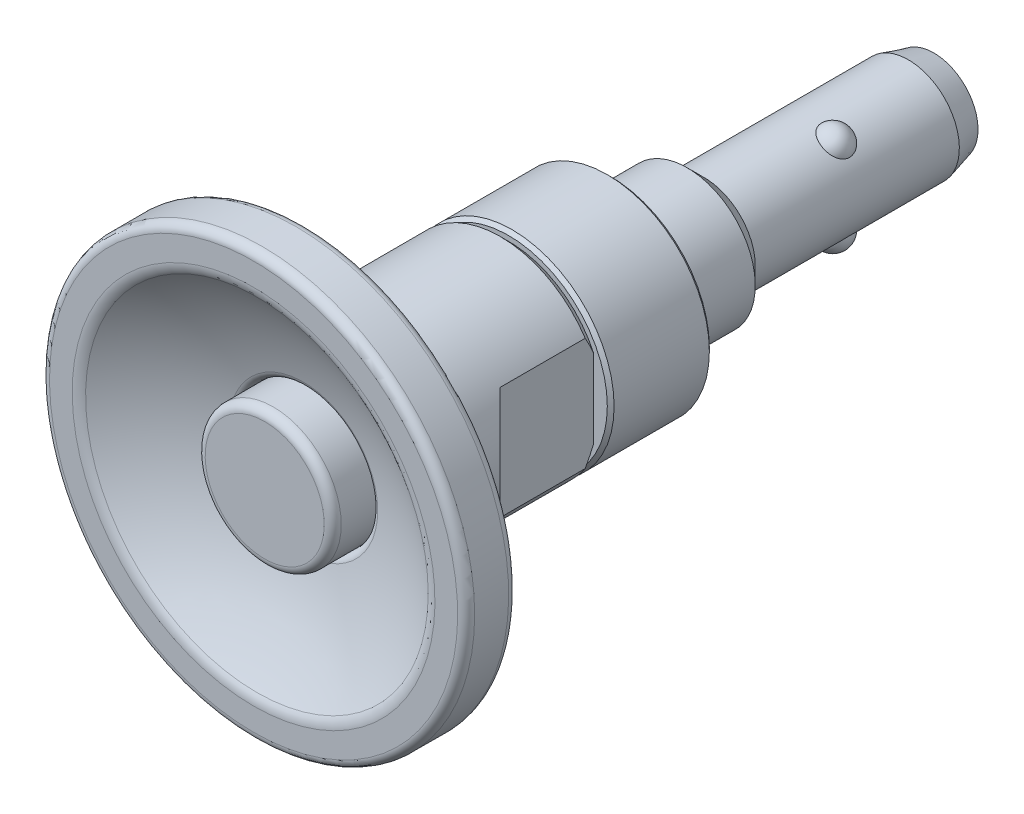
ISO-10303-21;
HEADER;
FILE_DESCRIPTION(('STEP AP214'),'2;1');
FILE_NAME('part.step','',(''),(''),'','','');
FILE_SCHEMA(('AUTOMOTIVE_DESIGN { 1 0 10303 214 1 1 1 1 }'));
ENDSEC;
DATA;
#1=APPLICATION_CONTEXT('core data for automotive mechanical design processes');
#2=APPLICATION_PROTOCOL_DEFINITION('international standard','automotive_design',2000,#1);
#3=PRODUCT_CONTEXT('',#1,'mechanical');
#4=PRODUCT('Part','Part','',(#3));
#5=PRODUCT_RELATED_PRODUCT_CATEGORY('part','',(#4));
#6=PRODUCT_DEFINITION_FORMATION('','',#4);
#7=PRODUCT_DEFINITION_CONTEXT('part definition',#1,'design');
#8=PRODUCT_DEFINITION('design','',#6,#7);
#9=PRODUCT_DEFINITION_SHAPE('','',#8);
#10=(LENGTH_UNIT() NAMED_UNIT(*) SI_UNIT(.MILLI.,.METRE.));
#11=(NAMED_UNIT(*) PLANE_ANGLE_UNIT() SI_UNIT($,.RADIAN.));
#12=(NAMED_UNIT(*) SI_UNIT($,.STERADIAN.) SOLID_ANGLE_UNIT());
#13=UNCERTAINTY_MEASURE_WITH_UNIT(LENGTH_MEASURE(1.E-05),#10,'distance_accuracy_value','');
#14=(GEOMETRIC_REPRESENTATION_CONTEXT(3) GLOBAL_UNCERTAINTY_ASSIGNED_CONTEXT((#13)) GLOBAL_UNIT_ASSIGNED_CONTEXT((#10,
#11,#12)) REPRESENTATION_CONTEXT('',''));
#15=CARTESIAN_POINT('',(0.,0.,0.));
#16=DIRECTION('',(0.,0.,1.));
#17=DIRECTION('',(1.,0.,0.));
#18=AXIS2_PLACEMENT_3D('',#15,#16,#17);
#19=CARTESIAN_POINT('',(1.25745735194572,-2.17798002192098,-11.8));
#20=DIRECTION('',(-0.500000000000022,0.866025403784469,0.));
#21=DIRECTION('',(0.,0.,-1.));
#22=AXIS2_PLACEMENT_3D('',#19,#20,#21);
#23=SPHERICAL_SURFACE('',#22,1.);
#24=CARTESIAN_POINT('',(2.2405663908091,-1.99495920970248,-11.8));
#25=CARTESIAN_POINT('',(2.24056631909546,-1.99495956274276,-11.8461997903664));
#26=CARTESIAN_POINT('',(2.23786747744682,-1.99800289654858,-11.8924030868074));
#27=CARTESIAN_POINT('',(2.22713107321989,-2.00996266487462,-11.983409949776));
#28=CARTESIAN_POINT('',(2.21909208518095,-2.0188806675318,-12.0282131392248));
#29=CARTESIAN_POINT('',(2.19786885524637,-2.04196358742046,-12.1150425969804));
#30=CARTESIAN_POINT('',(2.18469611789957,-2.05611676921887,-12.1570748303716));
#31=CARTESIAN_POINT('',(2.15345971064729,-2.08880832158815,-12.2374414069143));
#32=CARTESIAN_POINT('',(2.13539539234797,-2.10734727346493,-12.2757752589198));
#33=CARTESIAN_POINT('',(2.09404035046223,-2.14845746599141,-12.3491094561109));
#34=CARTESIAN_POINT('',(2.07060081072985,-2.17113880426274,-12.3839637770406));
#35=CARTESIAN_POINT('',(2.01925802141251,-2.21896993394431,-12.4482638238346));
#36=CARTESIAN_POINT('',(1.99135360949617,-2.24412036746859,-12.4777081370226));
#37=CARTESIAN_POINT('',(1.92921474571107,-2.29781233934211,-12.5328114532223));
#38=CARTESIAN_POINT('',(1.89465658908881,-2.32646544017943,-12.5579971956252));
#39=CARTESIAN_POINT('',(1.82157431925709,-2.38412134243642,-12.6011946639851));
#40=CARTESIAN_POINT('',(1.78304902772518,-2.41312424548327,-12.6192042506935));
#41=CARTESIAN_POINT('',(1.70065330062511,-2.47193714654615,-12.648581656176));
#42=CARTESIAN_POINT('',(1.65660658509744,-2.5017061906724,-12.6595384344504));
#43=CARTESIAN_POINT('',(1.56606022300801,-2.55936273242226,-12.6730632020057));
#44=CARTESIAN_POINT('',(1.51956022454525,-2.58724995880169,-12.675629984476));
#45=CARTESIAN_POINT('',(1.42431874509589,-2.6409024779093,-12.6723034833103));
#46=CARTESIAN_POINT('',(1.37555056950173,-2.66660929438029,-12.6662272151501));
#47=CARTESIAN_POINT('',(1.27819603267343,-2.71462002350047,-12.6453652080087));
#48=CARTESIAN_POINT('',(1.22960968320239,-2.7369237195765,-12.630578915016));
#49=CARTESIAN_POINT('',(1.13428398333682,-2.77778449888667,-12.5925339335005));
#50=CARTESIAN_POINT('',(1.08754241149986,-2.79634620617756,-12.5692858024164));
#51=CARTESIAN_POINT('',(0.997563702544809,-2.82969436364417,-12.5146818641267));
#52=CARTESIAN_POINT('',(0.95432641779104,-2.84448097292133,-12.4833263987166));
#53=CARTESIAN_POINT('',(0.874277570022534,-2.87008012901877,-12.4140490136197));
#54=CARTESIAN_POINT('',(0.837323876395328,-2.88098931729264,-12.3763275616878));
#55=CARTESIAN_POINT('',(0.770184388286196,-2.89966092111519,-12.2945932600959));
#56=CARTESIAN_POINT('',(0.739995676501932,-2.90742469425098,-12.2505831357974));
#57=CARTESIAN_POINT('',(0.689722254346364,-2.91974521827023,-12.1605282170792));
#58=CARTESIAN_POINT('',(0.669105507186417,-2.92447862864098,-12.1148051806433));
#59=CARTESIAN_POINT('',(0.636345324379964,-2.93178281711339,-12.0202582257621));
#60=CARTESIAN_POINT('',(0.624196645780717,-2.93435493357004,-11.9714362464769));
#61=CARTESIAN_POINT('',(0.60969621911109,-2.93740024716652,-11.8762808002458));
#62=CARTESIAN_POINT('',(0.606642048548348,-2.93802412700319,-11.8300582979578));
#63=CARTESIAN_POINT('',(0.608482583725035,-2.9376436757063,-11.7377843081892));
#64=CARTESIAN_POINT('',(0.613375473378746,-2.93663971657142,-11.6917327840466));
#65=CARTESIAN_POINT('',(0.63053844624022,-2.93300068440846,-11.6027655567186));
#66=CARTESIAN_POINT('',(0.642547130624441,-2.930423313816,-11.559796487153));
#67=CARTESIAN_POINT('',(0.673148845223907,-2.92354492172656,-11.476425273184));
#68=CARTESIAN_POINT('',(0.691742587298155,-2.9192437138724,-11.4360234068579));
#69=CARTESIAN_POINT('',(0.735458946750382,-2.90854284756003,-11.357373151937));
#70=CARTESIAN_POINT('',(0.760784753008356,-2.90207588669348,-11.3192472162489));
#71=CARTESIAN_POINT('',(0.816602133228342,-2.88686621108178,-11.2475035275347));
#72=CARTESIAN_POINT('',(0.847095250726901,-2.87812281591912,-11.2138871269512));
#73=CARTESIAN_POINT('',(0.914597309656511,-2.85741947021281,-11.1494153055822));
#74=CARTESIAN_POINT('',(0.951922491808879,-2.84526835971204,-11.1189523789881));
#75=CARTESIAN_POINT('',(1.02996337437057,-2.81795761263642,-11.0643839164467));
#76=CARTESIAN_POINT('',(1.07068016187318,-2.80279700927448,-11.0402804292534));
#77=CARTESIAN_POINT('',(1.15709228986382,-2.76829255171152,-10.9973428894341));
#78=CARTESIAN_POINT('',(1.20293761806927,-2.74873331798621,-10.978982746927));
#79=CARTESIAN_POINT('',(1.29557162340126,-2.70630578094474,-10.9501623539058));
#80=CARTESIAN_POINT('',(1.3423604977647,-2.68343677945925,-10.9397037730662));
#81=CARTESIAN_POINT('',(1.43722588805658,-2.63388425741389,-10.92658991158));
#82=CARTESIAN_POINT('',(1.48528716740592,-2.60709207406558,-10.9242329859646));
#83=CARTESIAN_POINT('',(1.57959366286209,-2.55105735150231,-10.9281888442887));
#84=CARTESIAN_POINT('',(1.62583870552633,-2.52181457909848,-10.9345024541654));
#85=CARTESIAN_POINT('',(1.71569281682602,-2.46157455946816,-10.9558082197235));
#86=CARTESIAN_POINT('',(1.75927518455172,-2.43056416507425,-10.9708760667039));
#87=CARTESIAN_POINT('',(1.84227905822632,-2.36826975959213,-11.0095322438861));
#88=CARTESIAN_POINT('',(1.88170046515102,-2.33698574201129,-11.0331207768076));
#89=CARTESIAN_POINT('',(1.95498929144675,-2.27601892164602,-11.0880826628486));
#90=CARTESIAN_POINT('',(1.98892124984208,-2.24632076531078,-11.1193526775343));
#91=CARTESIAN_POINT('',(2.05107923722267,-2.18971305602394,-11.1892521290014));
#92=CARTESIAN_POINT('',(2.07930615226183,-2.16280307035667,-11.2278804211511));
#93=CARTESIAN_POINT('',(2.12825022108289,-2.11463443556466,-11.3096673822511));
#94=CARTESIAN_POINT('',(2.14925472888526,-2.09317171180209,-11.3525332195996));
#95=CARTESIAN_POINT('',(2.18501161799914,-2.05582036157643,-11.4430266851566));
#96=CARTESIAN_POINT('',(2.19976977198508,-2.03992659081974,-11.4906498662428));
#97=CARTESIAN_POINT('',(2.22094703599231,-2.01682944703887,-11.5816600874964));
#98=CARTESIAN_POINT('',(2.22829180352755,-2.00867324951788,-11.6245931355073));
#99=CARTESIAN_POINT('',(2.23810081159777,-1.99773873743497,-11.7116832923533));
#100=CARTESIAN_POINT('',(2.2405664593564,-1.9949588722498,-11.7558400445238));
#101=CARTESIAN_POINT('',(2.2405663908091,-1.99495920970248,-11.8));
#102=B_SPLINE_CURVE_WITH_KNOTS('',3,(#24,#25,#26,#27,#28,#29,#30,#31,#32,#33,#34,#35,#36,#37,
#38,#39,#40,#41,#42,#43,#44,#45,#46,#47,#48,#49,#50,#51,#52,#53,#54,#55,#56,#57,#58,#59,#60,#61,
#62,#63,#64,#65,#66,#67,#68,#69,#70,#71,#72,#73,#74,#75,#76,#77,#78,#79,#80,#81,#82,#83,#84,#85,
#86,#87,#88,#89,#90,#91,#92,#93,#94,#95,#96,#97,#98,#99,#100,#101),.UNSPECIFIED.,.T.,.F.,(4,2,2,
2,2,2,2,2,2,2,2,2,2,2,2,2,2,2,2,2,2,2,2,2,2,2,2,2,2,2,2,2,2,2,2,2,2,2,4),(0.,0.138430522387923,
0.276898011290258,0.415056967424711,0.553234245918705,0.695835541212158,0.838474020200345,
0.992219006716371,1.14600979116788,1.30810293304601,1.47021938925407,1.63581958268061,
1.80143031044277,1.96683511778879,2.1322329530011,2.29315873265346,2.45401498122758,
2.60434189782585,2.75457565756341,2.89285916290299,3.03111107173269,3.16457426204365,
3.29805188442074,3.43613636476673,3.57426216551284,3.72268228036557,3.87115015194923,
4.02978554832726,4.18845445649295,4.35290739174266,4.51737599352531,4.68328825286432,
4.84920445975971,5.01300034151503,5.17677076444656,5.33295320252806,5.48899098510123,
5.62134763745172,5.75366611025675),.UNSPECIFIED.);
#103=CARTESIAN_POINT('',(2.2405663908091,-1.99495920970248,-11.8));
#104=VERTEX_POINT('',#103);
#105=EDGE_CURVE('E9',#104,#104,#102,.T.);
#106=ORIENTED_EDGE('',*,*,#105,.F.);
#107=EDGE_LOOP('',(#106));
#108=FACE_BOUND('',#107,.T.);
#109=ADVANCED_FACE('F14',(#108),#23,.T.);
#110=CARTESIAN_POINT('',(0.,0.,20.3464045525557));
#111=DIRECTION('',(0.,0.,-1.));
#112=DIRECTION('',(0.,1.,0.));
#113=AXIS2_PLACEMENT_3D('',#110,#111,#112);
#114=PLANE('',#113);
#115=CARTESIAN_POINT('',(0.,0.,20.3464045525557));
#116=DIRECTION('',(0.,0.,-1.));
#117=DIRECTION('',(0.,1.,0.));
#118=AXIS2_PLACEMENT_3D('',#115,#116,#117);
#119=CIRCLE('',#118,3.5);
#120=CARTESIAN_POINT('',(0.,3.5,20.3464045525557));
#121=VERTEX_POINT('',#120);
#122=EDGE_CURVE('E330',#121,#121,#119,.F.);
#123=ORIENTED_EDGE('',*,*,#122,.T.);
#124=EDGE_LOOP('',(#123));
#125=FACE_BOUND('',#124,.T.);
#126=ADVANCED_FACE('F258',(#125),#114,.F.);
#127=CARTESIAN_POINT('',(0.,0.,19.8464045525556));
#128=DIRECTION('',(0.,0.,-1.));
#129=DIRECTION('',(0.,1.,0.));
#130=AXIS2_PLACEMENT_3D('',#127,#128,#129);
#131=TOROIDAL_SURFACE('',#130,3.5,0.5);
#132=CARTESIAN_POINT('',(0.,0.,19.8464045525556));
#133=DIRECTION('',(0.,0.,-1.));
#134=DIRECTION('',(0.,1.,0.));
#135=AXIS2_PLACEMENT_3D('',#132,#133,#134);
#136=CIRCLE('',#135,4.);
#137=CARTESIAN_POINT('',(0.,4.,19.8464045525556));
#138=VERTEX_POINT('',#137);
#139=EDGE_CURVE('E84',#138,#138,#136,.T.);
#140=ORIENTED_EDGE('',*,*,#139,.F.);
#141=EDGE_LOOP('',(#140));
#142=FACE_BOUND('',#141,.T.);
#143=ORIENTED_EDGE('',*,*,#122,.F.);
#144=EDGE_LOOP('',(#143));
#145=FACE_BOUND('',#144,.T.);
#146=ADVANCED_FACE('F260',(#142,#145),#131,.T.);
#147=CARTESIAN_POINT('',(0.,0.,79.9579051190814));
#148=DIRECTION('',(0.,0.,1.));
#149=DIRECTION('',(0.,-1.,0.));
#150=AXIS2_PLACEMENT_3D('',#147,#148,#149);
#151=CYLINDRICAL_SURFACE('',#150,4.);
#152=ORIENTED_EDGE('',*,*,#139,.T.);
#153=EDGE_LOOP('',(#152));
#154=FACE_BOUND('',#153,.T.);
#155=CARTESIAN_POINT('',(0.,0.,17.5884654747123));
#156=DIRECTION('',(0.,0.,1.));
#157=DIRECTION('',(0.,-1.,0.));
#158=AXIS2_PLACEMENT_3D('',#155,#156,#157);
#159=CIRCLE('',#158,4.);
#160=CARTESIAN_POINT('',(0.,-4.,17.5884654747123));
#161=VERTEX_POINT('',#160);
#162=EDGE_CURVE('E361',#161,#161,#159,.T.);
#163=ORIENTED_EDGE('',*,*,#162,.T.);
#164=EDGE_LOOP('',(#163));
#165=FACE_BOUND('',#164,.T.);
#166=ADVANCED_FACE('F268',(#154,#165),#151,.T.);
#167=CARTESIAN_POINT('',(0.,0.,17.5884654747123));
#168=DIRECTION('',(0.,0.,1.));
#169=DIRECTION('',(0.,-1.,0.));
#170=AXIS2_PLACEMENT_3D('',#167,#168,#169);
#171=TOROIDAL_SURFACE('',#170,4.5,0.5);
#172=CARTESIAN_POINT('',(0.,0.,18.0716521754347));
#173=DIRECTION('',(0.,0.,1.));
#174=DIRECTION('',(0.,-1.,0.));
#175=AXIS2_PLACEMENT_3D('',#172,#173,#174);
#176=CIRCLE('',#175,4.37142857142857);
#177=CARTESIAN_POINT('',(4.37142857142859,0.,18.0716521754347));
#178=VERTEX_POINT('',#177);
#179=EDGE_CURVE('E358',#178,#178,#176,.F.);
#180=ORIENTED_EDGE('',*,*,#179,.F.);
#181=EDGE_LOOP('',(#180));
#182=FACE_BOUND('',#181,.T.);
#183=ORIENTED_EDGE('',*,*,#162,.F.);
#184=EDGE_LOOP('',(#183));
#185=FACE_BOUND('',#184,.T.);
#186=ADVANCED_FACE('F183',(#182,#185),#171,.T.);
#187=CARTESIAN_POINT('',(0.,0.,34.5));
#188=DIRECTION('',(0.,0.,-1.));
#189=DIRECTION('',(1.,0.,0.));
#190=AXIS2_PLACEMENT_3D('',#187,#188,#189);
#191=SPHERICAL_SURFACE('',#190,17.);
#192=CARTESIAN_POINT('',(0.,0.,20.8055555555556));
#193=DIRECTION('',(0.,0.,1.));
#194=DIRECTION('',(0.,-1.,0.));
#195=AXIS2_PLACEMENT_3D('',#192,#193,#194);
#196=CIRCLE('',#195,10.0728442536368);
#197=CARTESIAN_POINT('',(10.0728442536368,0.,20.8055555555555));
#198=VERTEX_POINT('',#197);
#199=EDGE_CURVE('E355',#198,#198,#196,.T.);
#200=CARTESIAN_POINT('',(10.0728442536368,0.,20.8055555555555));
#201=CARTESIAN_POINT('',(10.0194759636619,0.,20.7663008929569));
#202=CARTESIAN_POINT('',(9.96587818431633,0.,20.7273582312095));
#203=CARTESIAN_POINT('',(9.85823102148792,0.,20.6501021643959));
#204=CARTESIAN_POINT('',(9.8041816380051,0.,20.6117887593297));
#205=CARTESIAN_POINT('',(9.69563864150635,0.,20.5357964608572));
#206=CARTESIAN_POINT('',(9.64114502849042,0.,20.4981175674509));
#207=CARTESIAN_POINT('',(9.53172102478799,0.,20.4233994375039));
#208=CARTESIAN_POINT('',(9.47679063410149,0.,20.3863602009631));
#209=CARTESIAN_POINT('',(9.36650058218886,0.,20.3129264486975));
#210=CARTESIAN_POINT('',(9.31114092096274,0.,20.2765319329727));
#211=CARTESIAN_POINT('',(9.19999989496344,0.,20.204392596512));
#212=CARTESIAN_POINT('',(9.14421853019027,0.,20.1686477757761));
#213=CARTESIAN_POINT('',(9.03224172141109,0.,20.0978127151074));
#214=CARTESIAN_POINT('',(8.97604627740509,0.,20.0627224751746));
#215=CARTESIAN_POINT('',(8.86324899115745,0.,19.993201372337));
#216=CARTESIAN_POINT('',(8.80664714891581,0.,19.9587705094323));
#217=CARTESIAN_POINT('',(8.69304480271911,0.,19.8905728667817));
#218=CARTESIAN_POINT('',(8.63604429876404,0.,19.8568060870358));
#219=CARTESIAN_POINT('',(8.52165242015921,0.,19.7899412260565));
#220=CARTESIAN_POINT('',(8.46426104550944,0.,19.756843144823));
#221=CARTESIAN_POINT('',(8.3490952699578,0.,19.6913202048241));
#222=CARTESIAN_POINT('',(8.29132086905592,0.,19.6588953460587));
#223=CARTESIAN_POINT('',(8.17539693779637,0.,19.5947232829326));
#224=CARTESIAN_POINT('',(8.11724740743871,0.,19.5629760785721));
#225=CARTESIAN_POINT('',(8.00058116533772,0.,19.5001636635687));
#226=CARTESIAN_POINT('',(7.94206445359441,0.,19.4690984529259));
#227=CARTESIAN_POINT('',(7.82467184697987,0.,19.407654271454));
#228=CARTESIAN_POINT('',(7.76579595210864,0.,19.3772753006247));
#229=CARTESIAN_POINT('',(7.64769302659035,0.,19.3172077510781));
#230=CARTESIAN_POINT('',(7.58846599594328,0.,19.2875191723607));
#231=CARTESIAN_POINT('',(7.46966889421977,0.,19.2288364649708));
#232=CARTESIAN_POINT('',(7.41009882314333,0.,19.1998423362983));
#233=CARTESIAN_POINT('',(7.29062378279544,0.,19.1425524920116));
#234=CARTESIAN_POINT('',(7.23071881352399,0.,19.1142567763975));
#235=CARTESIAN_POINT('',(7.11058216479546,0.,19.0583676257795));
#236=CARTESIAN_POINT('',(7.05035048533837,0.,19.0307741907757));
#237=CARTESIAN_POINT('',(6.92956864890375,0.,18.9762933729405));
#238=CARTESIAN_POINT('',(6.86901849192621,0.,18.949405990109));
#239=CARTESIAN_POINT('',(6.74760797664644,0.,18.8963409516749));
#240=CARTESIAN_POINT('',(6.68674761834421,0.,18.8701632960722));
#241=CARTESIAN_POINT('',(6.56472501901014,0.,18.8185212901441));
#242=CARTESIAN_POINT('',(6.5035627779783,0.,18.7930569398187));
#243=CARTESIAN_POINT('',(6.38094477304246,0.,18.7428450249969));
#244=CARTESIAN_POINT('',(6.31948900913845,0.,18.7180974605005));
#245=CARTESIAN_POINT('',(6.19629235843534,0.,18.6693224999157));
#246=CARTESIAN_POINT('',(6.13455147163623,0.,18.6452951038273));
#247=CARTESIAN_POINT('',(6.0107930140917,0.,18.597963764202));
#248=CARTESIAN_POINT('',(5.94877544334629,0.,18.5746598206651));
#249=CARTESIAN_POINT('',(5.82447209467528,0.,18.528778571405));
#250=CARTESIAN_POINT('',(5.76218631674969,0.,18.5062012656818));
#251=CARTESIAN_POINT('',(5.63735506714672,0.,18.4617763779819));
#252=CARTESIAN_POINT('',(5.57480959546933,0.,18.4399287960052));
#253=CARTESIAN_POINT('',(5.44946750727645,0.,18.396966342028));
#254=CARTESIAN_POINT('',(5.38667089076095,0.,18.3758514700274));
#255=CARTESIAN_POINT('',(5.26083509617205,0.,18.3343573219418));
#256=CARTESIAN_POINT('',(5.19779591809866,0.,18.3139780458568));
#257=CARTESIAN_POINT('',(5.07148361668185,0.,18.2739578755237));
#258=CARTESIAN_POINT('',(5.00821049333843,0.,18.2543169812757));
#259=CARTESIAN_POINT('',(4.88143895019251,0.,18.2157762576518));
#260=CARTESIAN_POINT('',(4.81794053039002,0.,18.1968764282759));
#261=CARTESIAN_POINT('',(4.69072707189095,0.,18.1598204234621));
#262=CARTESIAN_POINT('',(4.62701203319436,0.,18.1416642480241));
#263=CARTESIAN_POINT('',(4.49937405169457,0.,18.1060980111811));
#264=CARTESIAN_POINT('',(4.43545110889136,0.,18.088687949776));
#265=CARTESIAN_POINT('',(4.37142857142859,0.,18.0716521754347));
#266=B_SPLINE_CURVE_WITH_KNOTS('',3,(#200,#201,#202,#203,#204,#205,#206,#207,#208,#209,#210,
#211,#212,#213,#214,#215,#216,#217,#218,#219,#220,#221,#222,#223,#224,#225,#226,#227,#228,#229,
#230,#231,#232,#233,#234,#235,#236,#237,#238,#239,#240,#241,#242,#243,#244,#245,#246,#247,#248,
#249,#250,#251,#252,#253,#254,#255,#256,#257,#258,#259,#260,#261,#262,#263,#264,#265),
.UNSPECIFIED.,.F.,.F.,(4,2,2,2,2,2,2,2,2,2,2,2,2,2,2,2,2,2,2,2,2,2,2,2,2,2,2,2,2,2,2,2,4),(0.,
0.198749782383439,0.397499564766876,0.596249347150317,0.794999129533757,0.993748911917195,
1.19249869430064,1.39124847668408,1.58999825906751,1.78874804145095,1.98749782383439,
2.18624760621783,2.38499738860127,2.58374717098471,2.78249695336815,2.98124673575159,
3.17999651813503,3.37874630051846,3.57749608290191,3.77624586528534,3.97499564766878,
4.17374543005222,4.37249521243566,4.5712449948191,4.76999477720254,4.96874455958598,
5.16749434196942,5.36624412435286,5.5649939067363,5.76374368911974,5.96249347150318,
6.16124325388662,6.35999303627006),.UNSPECIFIED.);
#267=EDGE_CURVE('BSEAM179',#198,#178,#266,.T.);
#268=ORIENTED_EDGE('',*,*,#199,.T.);
#269=ORIENTED_EDGE('',*,*,#179,.T.);
#270=ORIENTED_EDGE('',*,*,#267,.T.);
#271=ORIENTED_EDGE('',*,*,#267,.F.);
#272=EDGE_LOOP('',(#268,#270,#269,#271));
#273=FACE_BOUND('',#272,.T.);
#274=ADVANCED_FACE('F179',(#273),#191,.F.);
#275=CARTESIAN_POINT('',(0.,0.,20.));
#276=DIRECTION('',(0.,0.,1.));
#277=DIRECTION('',(0.,-1.,0.));
#278=AXIS2_PLACEMENT_3D('',#275,#276,#277);
#279=TOROIDAL_SURFACE('',#278,10.6653645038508,1.);
#280=CARTESIAN_POINT('',(0.,0.,21.));
#281=DIRECTION('',(0.,0.,1.));
#282=DIRECTION('',(0.,-1.,0.));
#283=AXIS2_PLACEMENT_3D('',#280,#281,#282);
#284=CIRCLE('',#283,10.6653645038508);
#285=CARTESIAN_POINT('',(0.,-10.6653645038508,21.));
#286=VERTEX_POINT('',#285);
#287=EDGE_CURVE('E352',#286,#286,#284,.F.);
#288=ORIENTED_EDGE('',*,*,#287,.F.);
#289=EDGE_LOOP('',(#288));
#290=FACE_BOUND('',#289,.T.);
#291=ORIENTED_EDGE('',*,*,#199,.F.);
#292=EDGE_LOOP('',(#291));
#293=FACE_BOUND('',#292,.T.);
#294=ADVANCED_FACE('F182',(#290,#293),#279,.T.);
#295=CARTESIAN_POINT('',(1.75,0.,21.));
#296=DIRECTION('',(0.,0.,1.));
#297=DIRECTION('',(0.,-1.,0.));
#298=AXIS2_PLACEMENT_3D('',#295,#296,#297);
#299=PLANE('',#298);
#300=ORIENTED_EDGE('',*,*,#287,.T.);
#301=EDGE_LOOP('',(#300));
#302=FACE_BOUND('',#301,.T.);
#303=CARTESIAN_POINT('',(0.,0.,21.));
#304=DIRECTION('',(0.,0.,1.));
#305=DIRECTION('',(0.,-1.,0.));
#306=AXIS2_PLACEMENT_3D('',#303,#304,#305);
#307=CIRCLE('',#306,12.);
#308=CARTESIAN_POINT('',(0.,-12.,21.));
#309=VERTEX_POINT('',#308);
#310=EDGE_CURVE('E130',#309,#309,#307,.T.);
#311=ORIENTED_EDGE('',*,*,#310,.T.);
#312=EDGE_LOOP('',(#311));
#313=FACE_BOUND('',#312,.T.);
#314=ADVANCED_FACE('F185',(#302,#313),#299,.T.);
#315=CARTESIAN_POINT('',(0.,0.,20.5));
#316=DIRECTION('',(0.,0.,1.));
#317=DIRECTION('',(0.,-1.,0.));
#318=AXIS2_PLACEMENT_3D('',#315,#316,#317);
#319=TOROIDAL_SURFACE('',#318,12.,0.5);
#320=ORIENTED_EDGE('',*,*,#310,.F.);
#321=EDGE_LOOP('',(#320));
#322=FACE_BOUND('',#321,.T.);
#323=CARTESIAN_POINT('',(0.,0.,20.5));
#324=DIRECTION('',(0.,0.,1.));
#325=DIRECTION('',(0.,-1.,0.));
#326=AXIS2_PLACEMENT_3D('',#323,#324,#325);
#327=CIRCLE('',#326,12.5);
#328=CARTESIAN_POINT('',(0.,-12.5,20.5));
#329=VERTEX_POINT('',#328);
#330=EDGE_CURVE('E127',#329,#329,#327,.F.);
#331=ORIENTED_EDGE('',*,*,#330,.F.);
#332=EDGE_LOOP('',(#331));
#333=FACE_BOUND('',#332,.T.);
#334=ADVANCED_FACE('F188',(#322,#333),#319,.T.);
#335=CARTESIAN_POINT('',(0.,0.,-5.5));
#336=DIRECTION('',(0.,0.,-1.));
#337=DIRECTION('',(0.,1.,0.));
#338=AXIS2_PLACEMENT_3D('',#335,#336,#337);
#339=CYLINDRICAL_SURFACE('',#338,12.5);
#340=ORIENTED_EDGE('',*,*,#330,.T.);
#341=EDGE_LOOP('',(#340));
#342=FACE_BOUND('',#341,.T.);
#343=CARTESIAN_POINT('',(0.,0.,18.5));
#344=DIRECTION('',(0.,0.,-1.));
#345=DIRECTION('',(0.,1.,0.));
#346=AXIS2_PLACEMENT_3D('',#343,#344,#345);
#347=CIRCLE('',#346,12.5);
#348=CARTESIAN_POINT('',(0.,12.5,18.5));
#349=VERTEX_POINT('',#348);
#350=EDGE_CURVE('E124',#349,#349,#347,.F.);
#351=ORIENTED_EDGE('',*,*,#350,.T.);
#352=EDGE_LOOP('',(#351));
#353=FACE_BOUND('',#352,.T.);
#354=ADVANCED_FACE('F201',(#342,#353),#339,.T.);
#355=CARTESIAN_POINT('',(0.,0.,18.5));
#356=DIRECTION('',(0.,0.,-1.));
#357=DIRECTION('',(0.,1.,0.));
#358=AXIS2_PLACEMENT_3D('',#355,#356,#357);
#359=TOROIDAL_SURFACE('',#358,12.,0.5);
#360=ORIENTED_EDGE('',*,*,#350,.F.);
#361=EDGE_LOOP('',(#360));
#362=FACE_BOUND('',#361,.T.);
#363=CARTESIAN_POINT('',(0.,0.,18.));
#364=DIRECTION('',(0.,0.,-1.));
#365=DIRECTION('',(0.,1.,0.));
#366=AXIS2_PLACEMENT_3D('',#363,#364,#365);
#367=CIRCLE('',#366,12.);
#368=CARTESIAN_POINT('',(0.,12.,18.));
#369=VERTEX_POINT('',#368);
#370=EDGE_CURVE('E133',#369,#369,#367,.T.);
#371=ORIENTED_EDGE('',*,*,#370,.F.);
#372=EDGE_LOOP('',(#371));
#373=FACE_BOUND('',#372,.T.);
#374=ADVANCED_FACE('F199',(#362,#373),#359,.T.);
#375=CARTESIAN_POINT('',(12.5,0.,18.));
#376=DIRECTION('',(0.,0.,-1.));
#377=DIRECTION('',(0.,1.,0.));
#378=AXIS2_PLACEMENT_3D('',#375,#376,#377);
#379=PLANE('',#378);
#380=ORIENTED_EDGE('',*,*,#370,.T.);
#381=EDGE_LOOP('',(#380));
#382=FACE_BOUND('',#381,.T.);
#383=CARTESIAN_POINT('',(0.,0.,18.));
#384=DIRECTION('',(0.,0.,-1.));
#385=DIRECTION('',(0.,1.,0.));
#386=AXIS2_PLACEMENT_3D('',#383,#384,#385);
#387=CIRCLE('',#386,10.);
#388=CARTESIAN_POINT('',(0.,10.,18.));
#389=VERTEX_POINT('',#388);
#390=EDGE_CURVE('E103',#389,#389,#387,.T.);
#391=ORIENTED_EDGE('',*,*,#390,.F.);
#392=EDGE_LOOP('',(#391));
#393=FACE_BOUND('',#392,.T.);
#394=ADVANCED_FACE('F195',(#382,#393),#379,.T.);
#395=CARTESIAN_POINT('',(0.,0.,14.));
#396=DIRECTION('',(0.,0.,-1.));
#397=DIRECTION('',(0.,1.,0.));
#398=AXIS2_PLACEMENT_3D('',#395,#396,#397);
#399=TOROIDAL_SURFACE('',#398,10.,4.);
#400=ORIENTED_EDGE('',*,*,#390,.T.);
#401=EDGE_LOOP('',(#400));
#402=FACE_BOUND('',#401,.T.);
#403=CARTESIAN_POINT('',(0.,0.,14.));
#404=DIRECTION('',(0.,0.,-1.));
#405=DIRECTION('',(0.,1.,0.));
#406=AXIS2_PLACEMENT_3D('',#403,#404,#405);
#407=CIRCLE('',#406,6.);
#408=CARTESIAN_POINT('',(0.,6.,14.));
#409=VERTEX_POINT('',#408);
#410=EDGE_CURVE('E100',#409,#409,#407,.T.);
#411=ORIENTED_EDGE('',*,*,#410,.F.);
#412=EDGE_LOOP('',(#411));
#413=FACE_BOUND('',#412,.T.);
#414=ADVANCED_FACE('F177',(#402,#413),#399,.F.);
#415=CARTESIAN_POINT('',(5.,14.,11.5));
#416=DIRECTION('',(-0.707106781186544,0.,0.707106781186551));
#417=DIRECTION('',(-0.707106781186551,0.,-0.707106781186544));
#418=AXIS2_PLACEMENT_3D('',#415,#416,#417);
#419=PLANE('',#418);
#420=DIRECTION('',(0.,-1.,0.));
#421=VECTOR('',#420,1.);
#422=CARTESIAN_POINT('',(5.,14.,11.5));
#423=LINE('',#422,#421);
#424=CARTESIAN_POINT('',(5.,3.3166247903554,11.5));
#425=VERTEX_POINT('',#424);
#426=CARTESIAN_POINT('',(5.,-3.3166247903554,11.5));
#427=VERTEX_POINT('',#426);
#428=EDGE_CURVE('E89',#425,#427,#423,.T.);
#429=ORIENTED_EDGE('',*,*,#428,.F.);
#430=CARTESIAN_POINT('',(0.,0.,6.5));
#431=DIRECTION('',(-0.707106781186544,0.,0.707106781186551));
#432=DIRECTION('',(-0.707106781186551,0.,-0.707106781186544));
#433=AXIS2_PLACEMENT_3D('',#430,#431,#432);
#434=ELLIPSE('',#433,8.48528137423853,6.);
#435=EDGE_CURVE('E138',#425,#427,#434,.F.);
#436=ORIENTED_EDGE('',*,*,#435,.T.);
#437=EDGE_LOOP('',(#429,#436));
#438=FACE_BOUND('',#437,.T.);
#439=ADVANCED_FACE('F173',(#438),#419,.F.);
#440=CARTESIAN_POINT('',(-5.,14.,11.5));
#441=DIRECTION('',(0.707106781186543,0.,0.707106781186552));
#442=DIRECTION('',(-0.707106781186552,0.,0.707106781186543));
#443=AXIS2_PLACEMENT_3D('',#440,#441,#442);
#444=PLANE('',#443);
#445=DIRECTION('',(0.,-1.,0.));
#446=VECTOR('',#445,1.);
#447=CARTESIAN_POINT('',(-5.,14.,11.5));
#448=LINE('',#447,#446);
#449=CARTESIAN_POINT('',(-5.,3.3166247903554,11.5));
#450=VERTEX_POINT('',#449);
#451=CARTESIAN_POINT('',(-5.,-3.3166247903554,11.5));
#452=VERTEX_POINT('',#451);
#453=EDGE_CURVE('E75',#450,#452,#448,.T.);
#454=ORIENTED_EDGE('',*,*,#453,.T.);
#455=CARTESIAN_POINT('',(0.,0.,6.5));
#456=DIRECTION('',(0.707106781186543,0.,0.707106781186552));
#457=DIRECTION('',(0.707106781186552,0.,-0.707106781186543));
#458=AXIS2_PLACEMENT_3D('',#455,#456,#457);
#459=ELLIPSE('',#458,8.48528137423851,6.);
#460=EDGE_CURVE('E72',#452,#450,#459,.F.);
#461=ORIENTED_EDGE('',*,*,#460,.T.);
#462=EDGE_LOOP('',(#454,#461));
#463=FACE_BOUND('',#462,.T.);
#464=ADVANCED_FACE('F74',(#463),#444,.F.);
#465=CARTESIAN_POINT('',(0.,0.,-5.5));
#466=DIRECTION('',(0.,0.,-1.));
#467=DIRECTION('',(0.,1.,0.));
#468=AXIS2_PLACEMENT_3D('',#465,#466,#467);
#469=CYLINDRICAL_SURFACE('',#468,6.);
#470=DIRECTION('',(0.,0.,-1.));
#471=VECTOR('',#470,1.);
#472=CARTESIAN_POINT('',(5.,3.3166247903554,-5.5));
#473=LINE('',#472,#471);
#474=CARTESIAN_POINT('',(5.,3.3166247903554,6.5));
#475=VERTEX_POINT('',#474);
#476=EDGE_CURVE('E98',#475,#425,#473,.F.);
#477=ORIENTED_EDGE('',*,*,#476,.F.);
#478=CARTESIAN_POINT('',(0.,0.,6.5));
#479=DIRECTION('',(0.,0.,-1.));
#480=DIRECTION('',(0.,1.,0.));
#481=AXIS2_PLACEMENT_3D('',#478,#479,#480);
#482=CIRCLE('',#481,6.);
#483=CARTESIAN_POINT('',(-5.,3.3166247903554,6.5));
#484=VERTEX_POINT('',#483);
#485=EDGE_CURVE('E31',#475,#484,#482,.F.);
#486=ORIENTED_EDGE('',*,*,#485,.T.);
#487=DIRECTION('',(0.,0.,-1.));
#488=VECTOR('',#487,1.);
#489=CARTESIAN_POINT('',(-5.,3.3166247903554,-5.5));
#490=LINE('',#489,#488);
#491=EDGE_CURVE('E81',#450,#484,#490,.T.);
#492=ORIENTED_EDGE('',*,*,#491,.F.);
#493=ORIENTED_EDGE('',*,*,#460,.F.);
#494=DIRECTION('',(0.,0.,-1.));
#495=VECTOR('',#494,1.);
#496=CARTESIAN_POINT('',(-5.,-3.3166247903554,-5.5));
#497=LINE('',#496,#495);
#498=CARTESIAN_POINT('',(-5.,-3.3166247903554,6.5));
#499=VERTEX_POINT('',#498);
#500=EDGE_CURVE('E83',#499,#452,#497,.F.);
#501=ORIENTED_EDGE('',*,*,#500,.F.);
#502=CARTESIAN_POINT('',(0.,0.,6.5));
#503=DIRECTION('',(0.,0.,-1.));
#504=DIRECTION('',(0.,1.,0.));
#505=AXIS2_PLACEMENT_3D('',#502,#503,#504);
#506=CIRCLE('',#505,6.);
#507=CARTESIAN_POINT('',(5.,-3.3166247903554,6.5));
#508=VERTEX_POINT('',#507);
#509=EDGE_CURVE('E702',#499,#508,#506,.F.);
#510=ORIENTED_EDGE('',*,*,#509,.T.);
#511=DIRECTION('',(0.,0.,-1.));
#512=VECTOR('',#511,1.);
#513=CARTESIAN_POINT('',(5.,-3.3166247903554,-5.5));
#514=LINE('',#513,#512);
#515=EDGE_CURVE('E95',#427,#508,#514,.T.);
#516=ORIENTED_EDGE('',*,*,#515,.F.);
#517=ORIENTED_EDGE('',*,*,#435,.F.);
#518=EDGE_LOOP('',(#477,#486,#492,#493,#501,#510,#516,#517));
#519=FACE_BOUND('',#518,.T.);
#520=ORIENTED_EDGE('',*,*,#410,.T.);
#521=EDGE_LOOP('',(#520));
#522=FACE_BOUND('',#521,.T.);
#523=ADVANCED_FACE('F86',(#519,#522),#469,.T.);
#524=CARTESIAN_POINT('',(0.,0.,-17.0535954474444));
#525=DIRECTION('',(0.,0.,1.));
#526=DIRECTION('',(0.,-1.,0.));
#527=AXIS2_PLACEMENT_3D('',#524,#525,#526);
#528=PLANE('',#527);
#529=CARTESIAN_POINT('',(0.,0.,-17.0535954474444));
#530=DIRECTION('',(0.,0.,1.));
#531=DIRECTION('',(0.,-1.,0.));
#532=AXIS2_PLACEMENT_3D('',#529,#530,#531);
#533=CIRCLE('',#532,0.4);
#534=CARTESIAN_POINT('',(0.,-0.400000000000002,-17.0535954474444));
#535=VERTEX_POINT('',#534);
#536=EDGE_CURVE('E320',#535,#535,#533,.T.);
#537=ORIENTED_EDGE('',*,*,#536,.F.);
#538=EDGE_LOOP('',(#537));
#539=FACE_BOUND('',#538,.T.);
#540=ADVANCED_FACE('F192',(#539),#528,.F.);
#541=CARTESIAN_POINT('',(0.,0.,6.));
#542=DIRECTION('',(0.,0.,1.));
#543=DIRECTION('',(0.,-1.,0.));
#544=AXIS2_PLACEMENT_3D('',#541,#542,#543);
#545=CONICAL_SURFACE('',#544,5.5,0.785398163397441);
#546=CARTESIAN_POINT('',(5.,-3.3166247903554,6.5));
#547=CARTESIAN_POINT('',(5.,-3.23335936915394,6.45397809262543));
#548=CARTESIAN_POINT('',(5.,-3.1495829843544,6.40886789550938));
#549=CARTESIAN_POINT('',(5.,-2.98100867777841,6.32075930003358));
#550=CARTESIAN_POINT('',(5.,-2.8962115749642,6.2777593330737));
#551=CARTESIAN_POINT('',(5.,-2.72546167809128,6.19408490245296));
#552=CARTESIAN_POINT('',(5.,-2.6395087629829,6.15341068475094));
#553=CARTESIAN_POINT('',(5.,-2.4663415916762,6.07466608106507));
#554=CARTESIAN_POINT('',(5.,-2.37912643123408,6.03659768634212));
#555=CARTESIAN_POINT('',(5.,-2.2912878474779,6.));
#556=B_SPLINE_CURVE_WITH_KNOTS('',3,(#546,#547,#548,#549,#550,#551,#552,#553,#554,#555),
.UNSPECIFIED.,.F.,.F.,(4,2,2,2,4),(0.,0.285415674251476,0.570615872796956,0.855846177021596,
1.14129206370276),.UNSPECIFIED.);
#557=CARTESIAN_POINT('',(5.,-2.2912878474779,6.));
#558=VERTEX_POINT('',#557);
#559=EDGE_CURVE('E145',#508,#558,#556,.T.);
#560=ORIENTED_EDGE('',*,*,#559,.F.);
#561=ORIENTED_EDGE('',*,*,#509,.F.);
#562=CARTESIAN_POINT('',(-5.,-2.2912878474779,6.));
#563=CARTESIAN_POINT('',(-5.,-2.37912643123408,6.03659768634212));
#564=CARTESIAN_POINT('',(-5.,-2.4663415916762,6.07466608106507));
#565=CARTESIAN_POINT('',(-5.,-2.63950876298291,6.15341068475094));
#566=CARTESIAN_POINT('',(-5.,-2.72546167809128,6.19408490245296));
#567=CARTESIAN_POINT('',(-5.,-2.8962115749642,6.2777593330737));
#568=CARTESIAN_POINT('',(-5.,-2.98100867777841,6.32075930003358));
#569=CARTESIAN_POINT('',(-5.,-3.1495829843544,6.40886789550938));
#570=CARTESIAN_POINT('',(-5.,-3.23335936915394,6.45397809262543));
#571=CARTESIAN_POINT('',(-5.,-3.3166247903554,6.5));
#572=B_SPLINE_CURVE_WITH_KNOTS('',3,(#562,#563,#564,#565,#566,#567,#568,#569,#570,#571),
.UNSPECIFIED.,.F.,.F.,(4,2,2,2,4),(0.,0.285445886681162,0.570676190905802,0.855876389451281,
1.14129206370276),.UNSPECIFIED.);
#573=CARTESIAN_POINT('',(-5.,-2.2912878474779,6.));
#574=VERTEX_POINT('',#573);
#575=EDGE_CURVE('E39',#574,#499,#572,.T.);
#576=ORIENTED_EDGE('',*,*,#575,.F.);
#577=CARTESIAN_POINT('',(0.,0.,6.));
#578=DIRECTION('',(0.,0.,-1.));
#579=DIRECTION('',(0.,1.,0.));
#580=AXIS2_PLACEMENT_3D('',#577,#578,#579);
#581=CIRCLE('',#580,5.5);
#582=EDGE_CURVE('E76',#558,#574,#581,.T.);
#583=ORIENTED_EDGE('',*,*,#582,.F.);
#584=EDGE_LOOP('',(#560,#561,#576,#583));
#585=FACE_BOUND('',#584,.T.);
#586=ADVANCED_FACE('F161',(#585),#545,.T.);
#587=CARTESIAN_POINT('',(5.,14.,11.5));
#588=DIRECTION('',(-1.,0.,0.));
#589=DIRECTION('',(0.,-1.,0.));
#590=AXIS2_PLACEMENT_3D('',#587,#588,#589);
#591=PLANE('',#590);
#592=DIRECTION('',(0.,1.,0.));
#593=VECTOR('',#592,1.);
#594=CARTESIAN_POINT('',(5.,0.,6.));
#595=LINE('',#594,#593);
#596=CARTESIAN_POINT('',(5.,2.2912878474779,6.));
#597=VERTEX_POINT('',#596);
#598=EDGE_CURVE('E136',#558,#597,#595,.T.);
#599=ORIENTED_EDGE('',*,*,#598,.T.);
#600=CARTESIAN_POINT('',(5.,2.2912878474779,6.));
#601=CARTESIAN_POINT('',(5.,2.37912643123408,6.03659768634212));
#602=CARTESIAN_POINT('',(5.,2.4663415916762,6.07466608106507));
#603=CARTESIAN_POINT('',(5.,2.6395087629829,6.15341068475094));
#604=CARTESIAN_POINT('',(5.,2.72546167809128,6.19408490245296));
#605=CARTESIAN_POINT('',(5.,2.89621157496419,6.2777593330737));
#606=CARTESIAN_POINT('',(5.,2.98100867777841,6.32075930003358));
#607=CARTESIAN_POINT('',(5.,3.1495829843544,6.40886789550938));
#608=CARTESIAN_POINT('',(5.,3.23335936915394,6.45397809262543));
#609=CARTESIAN_POINT('',(5.,3.3166247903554,6.5));
#610=B_SPLINE_CURVE_WITH_KNOTS('',3,(#600,#601,#602,#603,#604,#605,#606,#607,#608,#609),
.UNSPECIFIED.,.F.,.F.,(4,2,2,2,4),(0.,0.285445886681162,0.570676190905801,0.855876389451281,
1.14129206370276),.UNSPECIFIED.);
#611=EDGE_CURVE('E154',#597,#475,#610,.T.);
#612=ORIENTED_EDGE('',*,*,#611,.T.);
#613=ORIENTED_EDGE('',*,*,#476,.T.);
#614=ORIENTED_EDGE('',*,*,#428,.T.);
#615=ORIENTED_EDGE('',*,*,#515,.T.);
#616=ORIENTED_EDGE('',*,*,#559,.T.);
#617=EDGE_LOOP('',(#599,#612,#613,#614,#615,#616));
#618=FACE_BOUND('',#617,.T.);
#619=ADVANCED_FACE('F164',(#618),#591,.F.);
#620=CARTESIAN_POINT('',(0.,0.,6.));
#621=DIRECTION('',(0.,0.,1.));
#622=DIRECTION('',(0.,-1.,0.));
#623=AXIS2_PLACEMENT_3D('',#620,#621,#622);
#624=CONICAL_SURFACE('',#623,5.5,0.785398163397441);
#625=CARTESIAN_POINT('',(-5.,3.3166247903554,6.5));
#626=CARTESIAN_POINT('',(-5.,3.23335936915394,6.45397809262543));
#627=CARTESIAN_POINT('',(-5.,3.1495829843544,6.40886789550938));
#628=CARTESIAN_POINT('',(-5.,2.98100867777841,6.32075930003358));
#629=CARTESIAN_POINT('',(-5.,2.89621157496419,6.2777593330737));
#630=CARTESIAN_POINT('',(-5.,2.72546167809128,6.19408490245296));
#631=CARTESIAN_POINT('',(-5.,2.6395087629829,6.15341068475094));
#632=CARTESIAN_POINT('',(-5.,2.4663415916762,6.07466608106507));
#633=CARTESIAN_POINT('',(-5.,2.37912643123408,6.03659768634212));
#634=CARTESIAN_POINT('',(-5.,2.2912878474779,6.));
#635=B_SPLINE_CURVE_WITH_KNOTS('',3,(#625,#626,#627,#628,#629,#630,#631,#632,#633,#634),
.UNSPECIFIED.,.F.,.F.,(4,2,2,2,4),(0.,0.285415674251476,0.570615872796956,0.855846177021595,
1.14129206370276),.UNSPECIFIED.);
#636=CARTESIAN_POINT('',(-5.,2.2912878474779,6.));
#637=VERTEX_POINT('',#636);
#638=EDGE_CURVE('E364',#484,#637,#635,.T.);
#639=ORIENTED_EDGE('',*,*,#638,.F.);
#640=ORIENTED_EDGE('',*,*,#485,.F.);
#641=ORIENTED_EDGE('',*,*,#611,.F.);
#642=CARTESIAN_POINT('',(0.,0.,6.));
#643=DIRECTION('',(0.,0.,-1.));
#644=DIRECTION('',(0.,1.,0.));
#645=AXIS2_PLACEMENT_3D('',#642,#643,#644);
#646=CIRCLE('',#645,5.5);
#647=EDGE_CURVE('E142',#637,#597,#646,.T.);
#648=ORIENTED_EDGE('',*,*,#647,.F.);
#649=EDGE_LOOP('',(#639,#640,#641,#648));
#650=FACE_BOUND('',#649,.T.);
#651=ADVANCED_FACE('F169',(#650),#624,.T.);
#652=CARTESIAN_POINT('',(-5.,14.,11.5));
#653=DIRECTION('',(1.,0.,0.));
#654=DIRECTION('',(0.,1.,0.));
#655=AXIS2_PLACEMENT_3D('',#652,#653,#654);
#656=PLANE('',#655);
#657=ORIENTED_EDGE('',*,*,#491,.T.);
#658=ORIENTED_EDGE('',*,*,#638,.T.);
#659=DIRECTION('',(0.,-1.,0.));
#660=VECTOR('',#659,1.);
#661=CARTESIAN_POINT('',(-5.,0.,6.));
#662=LINE('',#661,#660);
#663=EDGE_CURVE('E77',#637,#574,#662,.T.);
#664=ORIENTED_EDGE('',*,*,#663,.T.);
#665=ORIENTED_EDGE('',*,*,#575,.T.);
#666=ORIENTED_EDGE('',*,*,#500,.T.);
#667=ORIENTED_EDGE('',*,*,#453,.F.);
#668=EDGE_LOOP('',(#657,#658,#664,#665,#666,#667));
#669=FACE_BOUND('',#668,.T.);
#670=ADVANCED_FACE('F79',(#669),#656,.F.);
#671=CARTESIAN_POINT('',(0.,0.,-16.1741725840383));
#672=DIRECTION('',(0.,0.,1.));
#673=DIRECTION('',(-1.,0.,0.));
#674=AXIS2_PLACEMENT_3D('',#671,#672,#673);
#675=CYLINDRICAL_SURFACE('',#674,0.4);
#676=CARTESIAN_POINT('',(0.,0.,-17.2741725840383));
#677=DIRECTION('',(0.,0.,1.));
#678=DIRECTION('',(-1.,0.,0.));
#679=AXIS2_PLACEMENT_3D('',#676,#677,#678);
#680=CIRCLE('',#679,0.4);
#681=CARTESIAN_POINT('',(-0.4,0.,-17.2741725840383));
#682=VERTEX_POINT('',#681);
#683=EDGE_CURVE('E341',#682,#682,#680,.T.);
#684=ORIENTED_EDGE('',*,*,#683,.F.);
#685=EDGE_LOOP('',(#684));
#686=FACE_BOUND('',#685,.T.);
#687=ORIENTED_EDGE('',*,*,#536,.T.);
#688=EDGE_LOOP('',(#687));
#689=FACE_BOUND('',#688,.T.);
#690=ADVANCED_FACE('F286',(#686,#689),#675,.F.);
#691=CARTESIAN_POINT('',(0.,0.,6.));
#692=DIRECTION('',(0.,0.,1.));
#693=DIRECTION('',(1.,0.,0.));
#694=AXIS2_PLACEMENT_3D('',#691,#692,#693);
#695=PLANE('',#694);
#696=ORIENTED_EDGE('',*,*,#663,.F.);
#697=ORIENTED_EDGE('',*,*,#647,.T.);
#698=ORIENTED_EDGE('',*,*,#598,.F.);
#699=ORIENTED_EDGE('',*,*,#582,.T.);
#700=EDGE_LOOP('',(#696,#697,#698,#699));
#701=FACE_BOUND('',#700,.T.);
#702=CARTESIAN_POINT('',(0.,0.,6.));
#703=DIRECTION('',(0.,0.,1.));
#704=DIRECTION('',(1.,0.,0.));
#705=AXIS2_PLACEMENT_3D('',#702,#703,#704);
#706=CIRCLE('',#705,5.8);
#707=CARTESIAN_POINT('',(5.8,0.,6.));
#708=VERTEX_POINT('',#707);
#709=EDGE_CURVE('E316',#708,#708,#706,.T.);
#710=ORIENTED_EDGE('',*,*,#709,.T.);
#711=EDGE_LOOP('',(#710));
#712=FACE_BOUND('',#711,.T.);
#713=ADVANCED_FACE('F282',(#701,#712),#695,.T.);
#714=CARTESIAN_POINT('',(0.,0.,-18.0535954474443));
#715=DIRECTION('',(0.,0.,-1.));
#716=DIRECTION('',(1.,0.,0.));
#717=AXIS2_PLACEMENT_3D('',#714,#715,#716);
#718=CONICAL_SURFACE('',#717,0.85,0.523598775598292);
#719=ORIENTED_EDGE('',*,*,#683,.T.);
#720=EDGE_LOOP('',(#719));
#721=FACE_BOUND('',#720,.T.);
#722=CARTESIAN_POINT('',(0.,0.,-18.0535954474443));
#723=DIRECTION('',(0.,0.,1.));
#724=DIRECTION('',(-1.,0.,0.));
#725=AXIS2_PLACEMENT_3D('',#722,#723,#724);
#726=CIRCLE('',#725,0.85);
#727=CARTESIAN_POINT('',(-0.85,0.,-18.0535954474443));
#728=VERTEX_POINT('',#727);
#729=EDGE_CURVE('E338',#728,#728,#726,.T.);
#730=ORIENTED_EDGE('',*,*,#729,.F.);
#731=EDGE_LOOP('',(#730));
#732=FACE_BOUND('',#731,.T.);
#733=ADVANCED_FACE('F285',(#721,#732),#718,.F.);
#734=CARTESIAN_POINT('',(0.,0.,6.));
#735=DIRECTION('',(0.,0.,-1.));
#736=DIRECTION('',(-1.,0.,0.));
#737=AXIS2_PLACEMENT_3D('',#734,#735,#736);
#738=CONICAL_SURFACE('',#737,5.8,0.78539816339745);
#739=CARTESIAN_POINT('',(0.,0.,5.8));
#740=DIRECTION('',(0.,0.,1.));
#741=DIRECTION('',(1.,0.,0.));
#742=AXIS2_PLACEMENT_3D('',#739,#740,#741);
#743=CIRCLE('',#742,6.);
#744=CARTESIAN_POINT('',(6.,0.,5.8));
#745=VERTEX_POINT('',#744);
#746=EDGE_CURVE('E313',#745,#745,#743,.F.);
#747=ORIENTED_EDGE('',*,*,#746,.F.);
#748=EDGE_LOOP('',(#747));
#749=FACE_BOUND('',#748,.T.);
#750=ORIENTED_EDGE('',*,*,#709,.F.);
#751=EDGE_LOOP('',(#750));
#752=FACE_BOUND('',#751,.T.);
#753=ADVANCED_FACE('F298',(#749,#752),#738,.T.);
#754=CARTESIAN_POINT('',(1.65,0.,-18.0535954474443));
#755=DIRECTION('',(0.,0.,1.));
#756=DIRECTION('',(0.,-1.,0.));
#757=AXIS2_PLACEMENT_3D('',#754,#755,#756);
#758=PLANE('',#757);
#759=CARTESIAN_POINT('',(0.,0.,-18.0535954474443));
#760=DIRECTION('',(0.,0.,1.));
#761=DIRECTION('',(0.,-1.,0.));
#762=AXIS2_PLACEMENT_3D('',#759,#760,#761);
#763=CIRCLE('',#762,1.45000000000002);
#764=CARTESIAN_POINT('',(0.,-1.45000000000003,-18.0535954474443));
#765=VERTEX_POINT('',#764);
#766=EDGE_CURVE('E332',#765,#765,#763,.F.);
#767=ORIENTED_EDGE('',*,*,#766,.T.);
#768=EDGE_LOOP('',(#767));
#769=FACE_BOUND('',#768,.T.);
#770=ORIENTED_EDGE('',*,*,#729,.T.);
#771=EDGE_LOOP('',(#770));
#772=FACE_BOUND('',#771,.T.);
#773=ADVANCED_FACE('F294',(#769,#772),#758,.F.);
#774=CARTESIAN_POINT('',(0.,0.,6.));
#775=DIRECTION('',(0.,0.,-1.));
#776=DIRECTION('',(-1.,0.,0.));
#777=AXIS2_PLACEMENT_3D('',#774,#775,#776);
#778=CYLINDRICAL_SURFACE('',#777,6.);
#779=CARTESIAN_POINT('',(0.,0.,0.199999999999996));
#780=DIRECTION('',(0.,0.,1.));
#781=DIRECTION('',(1.,0.,0.));
#782=AXIS2_PLACEMENT_3D('',#779,#780,#781);
#783=CIRCLE('',#782,6.);
#784=CARTESIAN_POINT('',(6.,0.,0.199999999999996));
#785=VERTEX_POINT('',#784);
#786=EDGE_CURVE('E322',#785,#785,#783,.T.);
#787=ORIENTED_EDGE('',*,*,#786,.T.);
#788=EDGE_LOOP('',(#787));
#789=FACE_BOUND('',#788,.T.);
#790=ORIENTED_EDGE('',*,*,#746,.T.);
#791=EDGE_LOOP('',(#790));
#792=FACE_BOUND('',#791,.T.);
#793=ADVANCED_FACE('F279',(#789,#792),#778,.T.);
#794=CARTESIAN_POINT('',(0.,0.,-17.8535954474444));
#795=DIRECTION('',(0.,0.,1.));
#796=DIRECTION('',(0.,-1.,0.));
#797=AXIS2_PLACEMENT_3D('',#794,#795,#796);
#798=CONICAL_SURFACE('',#797,1.65,0.785398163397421);
#799=ORIENTED_EDGE('',*,*,#766,.F.);
#800=EDGE_LOOP('',(#799));
#801=FACE_BOUND('',#800,.T.);
#802=CARTESIAN_POINT('',(0.,0.,-17.8535954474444));
#803=DIRECTION('',(0.,0.,1.));
#804=DIRECTION('',(0.,-1.,0.));
#805=AXIS2_PLACEMENT_3D('',#802,#803,#804);
#806=CIRCLE('',#805,1.65);
#807=CARTESIAN_POINT('',(0.,-1.65,-17.8535954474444));
#808=VERTEX_POINT('',#807);
#809=EDGE_CURVE('E335',#808,#808,#806,.T.);
#810=ORIENTED_EDGE('',*,*,#809,.F.);
#811=EDGE_LOOP('',(#810));
#812=FACE_BOUND('',#811,.T.);
#813=ADVANCED_FACE('F276',(#801,#812),#798,.T.);
#814=CARTESIAN_POINT('',(0.,0.,0.199999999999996));
#815=DIRECTION('',(0.,0.,1.));
#816=DIRECTION('',(1.,0.,0.));
#817=AXIS2_PLACEMENT_3D('',#814,#815,#816);
#818=CONICAL_SURFACE('',#817,6.,0.785398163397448);
#819=CARTESIAN_POINT('',(0.,0.,0.));
#820=DIRECTION('',(0.,0.,1.));
#821=DIRECTION('',(1.,0.,0.));
#822=AXIS2_PLACEMENT_3D('',#819,#820,#821);
#823=CIRCLE('',#822,5.8);
#824=CARTESIAN_POINT('',(5.8,0.,0.));
#825=VERTEX_POINT('',#824);
#826=EDGE_CURVE('E318',#825,#825,#823,.F.);
#827=ORIENTED_EDGE('',*,*,#826,.F.);
#828=EDGE_LOOP('',(#827));
#829=FACE_BOUND('',#828,.T.);
#830=ORIENTED_EDGE('',*,*,#786,.F.);
#831=EDGE_LOOP('',(#830));
#832=FACE_BOUND('',#831,.T.);
#833=ADVANCED_FACE('F278',(#829,#832),#818,.T.);
#834=CARTESIAN_POINT('',(0.,0.,79.9579051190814));
#835=DIRECTION('',(0.,0.,1.));
#836=DIRECTION('',(0.,-1.,0.));
#837=AXIS2_PLACEMENT_3D('',#834,#835,#836);
#838=CYLINDRICAL_SURFACE('',#837,1.65);
#839=CARTESIAN_POINT('',(0.,0.,-14.2));
#840=DIRECTION('',(0.,0.,-1.));
#841=DIRECTION('',(0.,1.,0.));
#842=AXIS2_PLACEMENT_3D('',#839,#840,#841);
#843=CIRCLE('',#842,1.65);
#844=CARTESIAN_POINT('',(0.,1.65,-14.2));
#845=VERTEX_POINT('',#844);
#846=EDGE_CURVE('E346',#845,#845,#843,.F.);
#847=ORIENTED_EDGE('',*,*,#846,.F.);
#848=EDGE_LOOP('',(#847));
#849=FACE_BOUND('',#848,.T.);
#850=ORIENTED_EDGE('',*,*,#809,.T.);
#851=EDGE_LOOP('',(#850));
#852=FACE_BOUND('',#851,.T.);
#853=ADVANCED_FACE('F290',(#849,#852),#838,.T.);
#854=CARTESIAN_POINT('',(0.,0.,0.));
#855=DIRECTION('',(0.,0.,1.));
#856=DIRECTION('',(1.,0.,0.));
#857=AXIS2_PLACEMENT_3D('',#854,#855,#856);
#858=PLANE('',#857);
#859=CARTESIAN_POINT('',(0.,0.,0.));
#860=DIRECTION('',(0.,0.,1.));
#861=DIRECTION('',(1.,0.,0.));
#862=AXIS2_PLACEMENT_3D('',#859,#860,#861);
#863=CIRCLE('',#862,4.2);
#864=CARTESIAN_POINT('',(4.2,0.,0.));
#865=VERTEX_POINT('',#864);
#866=EDGE_CURVE('E18',#865,#865,#863,.T.);
#867=ORIENTED_EDGE('',*,*,#866,.T.);
#868=EDGE_LOOP('',(#867));
#869=FACE_BOUND('',#868,.T.);
#870=ORIENTED_EDGE('',*,*,#826,.T.);
#871=EDGE_LOOP('',(#870));
#872=FACE_BOUND('',#871,.T.);
#873=ADVANCED_FACE('F208',(#869,#872),#858,.F.);
#874=CARTESIAN_POINT('',(0.,0.,-14.2));
#875=DIRECTION('',(0.,0.,-1.));
#876=DIRECTION('',(0.,1.,0.));
#877=AXIS2_PLACEMENT_3D('',#874,#875,#876);
#878=PLANE('',#877);
#879=CARTESIAN_POINT('',(0.,0.,-14.2));
#880=DIRECTION('',(0.,0.,-1.));
#881=DIRECTION('',(0.,1.,0.));
#882=AXIS2_PLACEMENT_3D('',#879,#880,#881);
#883=CIRCLE('',#882,2.15);
#884=CARTESIAN_POINT('',(0.,2.15,-14.2));
#885=VERTEX_POINT('',#884);
#886=EDGE_CURVE('E107',#885,#885,#883,.T.);
#887=ORIENTED_EDGE('',*,*,#886,.T.);
#888=EDGE_LOOP('',(#887));
#889=FACE_BOUND('',#888,.T.);
#890=ORIENTED_EDGE('',*,*,#846,.T.);
#891=EDGE_LOOP('',(#890));
#892=FACE_BOUND('',#891,.T.);
#893=ADVANCED_FACE('F205',(#889,#892),#878,.T.);
#894=CARTESIAN_POINT('',(0.,0.,0.));
#895=DIRECTION('',(0.,0.,-1.));
#896=DIRECTION('',(-1.,0.,0.));
#897=AXIS2_PLACEMENT_3D('',#894,#895,#896);
#898=CONICAL_SURFACE('',#897,4.2,0.785398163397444);
#899=CARTESIAN_POINT('',(0.,0.,0.200000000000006));
#900=DIRECTION('',(0.,0.,-1.));
#901=DIRECTION('',(0.,1.,0.));
#902=AXIS2_PLACEMENT_3D('',#899,#900,#901);
#903=CIRCLE('',#902,4.);
#904=CARTESIAN_POINT('',(0.,4.,0.200000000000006));
#905=VERTEX_POINT('',#904);
#906=EDGE_CURVE('E349',#905,#905,#903,.T.);
#907=ORIENTED_EDGE('',*,*,#906,.F.);
#908=EDGE_LOOP('',(#907));
#909=FACE_BOUND('',#908,.T.);
#910=ORIENTED_EDGE('',*,*,#866,.F.);
#911=EDGE_LOOP('',(#910));
#912=FACE_BOUND('',#911,.T.);
#913=ADVANCED_FACE('F16',(#909,#912),#898,.F.);
#914=CARTESIAN_POINT('',(0.,0.,-14.2));
#915=DIRECTION('',(0.,0.,-1.));
#916=DIRECTION('',(0.,1.,0.));
#917=AXIS2_PLACEMENT_3D('',#914,#915,#916);
#918=CYLINDRICAL_SURFACE('',#917,2.15);
#919=ORIENTED_EDGE('',*,*,#886,.F.);
#920=EDGE_LOOP('',(#919));
#921=FACE_BOUND('',#920,.T.);
#922=CARTESIAN_POINT('',(0.,0.,-19.));
#923=DIRECTION('',(0.,0.,-1.));
#924=DIRECTION('',(0.,1.,0.));
#925=AXIS2_PLACEMENT_3D('',#922,#923,#924);
#926=CIRCLE('',#925,2.15);
#927=CARTESIAN_POINT('',(0.,2.15,-19.));
#928=VERTEX_POINT('',#927);
#929=EDGE_CURVE('E106',#928,#928,#926,.T.);
#930=ORIENTED_EDGE('',*,*,#929,.T.);
#931=EDGE_LOOP('',(#930));
#932=FACE_BOUND('',#931,.T.);
#933=ADVANCED_FACE('F210',(#921,#932),#918,.F.);
#934=CARTESIAN_POINT('',(0.,0.,64.6224672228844));
#935=DIRECTION('',(0.,0.,1.));
#936=DIRECTION('',(0.,-1.,0.));
#937=AXIS2_PLACEMENT_3D('',#934,#935,#936);
#938=CYLINDRICAL_SURFACE('',#937,4.);
#939=ORIENTED_EDGE('',*,*,#906,.T.);
#940=EDGE_LOOP('',(#939));
#941=FACE_BOUND('',#940,.T.);
#942=CARTESIAN_POINT('',(0.,0.,-4.5));
#943=DIRECTION('',(0.,0.,1.));
#944=DIRECTION('',(0.,-1.,0.));
#945=AXIS2_PLACEMENT_3D('',#942,#943,#944);
#946=CIRCLE('',#945,4.);
#947=CARTESIAN_POINT('',(0.,-4.,-4.5));
#948=VERTEX_POINT('',#947);
#949=EDGE_CURVE('E115',#948,#948,#946,.T.);
#950=ORIENTED_EDGE('',*,*,#949,.T.);
#951=EDGE_LOOP('',(#950));
#952=FACE_BOUND('',#951,.T.);
#953=ADVANCED_FACE('F213',(#941,#952),#938,.T.);
#954=CARTESIAN_POINT('',(3.,0.,-19.));
#955=DIRECTION('',(0.,0.,1.));
#956=DIRECTION('',(0.,-1.,0.));
#957=AXIS2_PLACEMENT_3D('',#954,#955,#956);
#958=PLANE('',#957);
#959=ORIENTED_EDGE('',*,*,#929,.F.);
#960=EDGE_LOOP('',(#959));
#961=FACE_BOUND('',#960,.T.);
#962=CARTESIAN_POINT('',(0.,0.,-19.));
#963=DIRECTION('',(0.,0.,1.));
#964=DIRECTION('',(0.,-1.,0.));
#965=AXIS2_PLACEMENT_3D('',#962,#963,#964);
#966=CIRCLE('',#965,2.59807621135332);
#967=CARTESIAN_POINT('',(0.,-2.59807621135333,-19.));
#968=VERTEX_POINT('',#967);
#969=EDGE_CURVE('E121',#968,#968,#966,.F.);
#970=ORIENTED_EDGE('',*,*,#969,.T.);
#971=EDGE_LOOP('',(#970));
#972=FACE_BOUND('',#971,.T.);
#973=ADVANCED_FACE('F215',(#961,#972),#958,.F.);
#974=CARTESIAN_POINT('',(1.25745735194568,2.17798002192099,-11.8));
#975=DIRECTION('',(-0.500000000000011,-0.866025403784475,0.));
#976=DIRECTION('',(0.,0.,-1.));
#977=AXIS2_PLACEMENT_3D('',#974,#975,#976);
#978=SPHERICAL_SURFACE('',#977,1.);
#979=CARTESIAN_POINT('',(2.24056639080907,1.99495920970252,-11.8));
#980=CARTESIAN_POINT('',(2.24056631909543,1.9949595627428,-11.7538002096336));
#981=CARTESIAN_POINT('',(2.23786747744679,1.99800289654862,-11.7075969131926));
#982=CARTESIAN_POINT('',(2.22713107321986,2.00996266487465,-11.616590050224));
#983=CARTESIAN_POINT('',(2.21909208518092,2.01888066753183,-11.5717868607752));
#984=CARTESIAN_POINT('',(2.19786885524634,2.04196358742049,-11.4849574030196));
#985=CARTESIAN_POINT('',(2.18469611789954,2.05611676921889,-11.4429251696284));
#986=CARTESIAN_POINT('',(2.15345971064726,2.08880832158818,-11.3625585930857));
#987=CARTESIAN_POINT('',(2.13539539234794,2.10734727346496,-11.3242247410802));
#988=CARTESIAN_POINT('',(2.0940403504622,2.14845746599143,-11.2508905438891));
#989=CARTESIAN_POINT('',(2.07060081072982,2.17113880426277,-11.2160362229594));
#990=CARTESIAN_POINT('',(2.01925802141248,2.21896993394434,-11.1517361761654));
#991=CARTESIAN_POINT('',(1.99135360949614,2.24412036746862,-11.1222918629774));
#992=CARTESIAN_POINT('',(1.92921474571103,2.29781233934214,-11.0671885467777));
#993=CARTESIAN_POINT('',(1.89465658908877,2.32646544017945,-11.0420028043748));
#994=CARTESIAN_POINT('',(1.82157431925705,2.38412134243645,-10.9988053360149));
#995=CARTESIAN_POINT('',(1.78304902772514,2.41312424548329,-10.9807957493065));
#996=CARTESIAN_POINT('',(1.70065330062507,2.47193714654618,-10.951418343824));
#997=CARTESIAN_POINT('',(1.6566065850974,2.50170619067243,-10.9404615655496));
#998=CARTESIAN_POINT('',(1.56606022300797,2.55936273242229,-10.9269367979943));
#999=CARTESIAN_POINT('',(1.51956022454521,2.58724995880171,-10.924370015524));
#1000=CARTESIAN_POINT('',(1.42431874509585,2.64090247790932,-10.9276965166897));
#1001=CARTESIAN_POINT('',(1.37555056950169,2.66660929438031,-10.93377278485));
#1002=CARTESIAN_POINT('',(1.27819603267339,2.71462002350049,-10.9546347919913));
#1003=CARTESIAN_POINT('',(1.22960968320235,2.73692371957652,-10.969421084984));
#1004=CARTESIAN_POINT('',(1.13428398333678,2.77778449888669,-11.0074660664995));
#1005=CARTESIAN_POINT('',(1.08754241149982,2.79634620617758,-11.0307141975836));
#1006=CARTESIAN_POINT('',(0.997563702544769,2.82969436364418,-11.0853181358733));
#1007=CARTESIAN_POINT('',(0.954326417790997,2.84448097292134,-11.1166736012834));
#1008=CARTESIAN_POINT('',(0.874277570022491,2.87008012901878,-11.1859509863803));
#1009=CARTESIAN_POINT('',(0.837323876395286,2.88098931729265,-11.2236724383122));
#1010=CARTESIAN_POINT('',(0.770184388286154,2.8996609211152,-11.3054067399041));
#1011=CARTESIAN_POINT('',(0.739995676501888,2.90742469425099,-11.3494168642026));
#1012=CARTESIAN_POINT('',(0.689722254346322,2.91974521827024,-11.4394717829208));
#1013=CARTESIAN_POINT('',(0.669105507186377,2.92447862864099,-11.4851948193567));
#1014=CARTESIAN_POINT('',(0.636345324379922,2.9317828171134,-11.5797417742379));
#1015=CARTESIAN_POINT('',(0.624196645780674,2.93435493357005,-11.6285637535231));
#1016=CARTESIAN_POINT('',(0.609696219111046,2.93740024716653,-11.7237191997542));
#1017=CARTESIAN_POINT('',(0.606642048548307,2.9380241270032,-11.7699417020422));
#1018=CARTESIAN_POINT('',(0.608482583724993,2.93764367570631,-11.8622156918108));
#1019=CARTESIAN_POINT('',(0.613375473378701,2.93663971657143,-11.9082672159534));
#1020=CARTESIAN_POINT('',(0.630538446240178,2.93300068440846,-11.9972344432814));
#1021=CARTESIAN_POINT('',(0.642547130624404,2.93042331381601,-12.040203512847));
#1022=CARTESIAN_POINT('',(0.673148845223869,2.92354492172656,-12.1235747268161));
#1023=CARTESIAN_POINT('',(0.69174258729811,2.91924371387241,-12.1639765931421));
#1024=CARTESIAN_POINT('',(0.735458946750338,2.90854284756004,-12.242626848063));
#1025=CARTESIAN_POINT('',(0.760784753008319,2.90207588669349,-12.2807527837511));
#1026=CARTESIAN_POINT('',(0.816602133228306,2.88686621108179,-12.3524964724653));
#1027=CARTESIAN_POINT('',(0.847095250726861,2.87812281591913,-12.3861128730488));
#1028=CARTESIAN_POINT('',(0.914597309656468,2.85741947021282,-12.4505846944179));
#1029=CARTESIAN_POINT('',(0.951922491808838,2.84526835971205,-12.4810476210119));
#1030=CARTESIAN_POINT('',(1.02996337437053,2.81795761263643,-12.5356160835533));
#1031=CARTESIAN_POINT('',(1.07068016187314,2.8027970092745,-12.5597195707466));
#1032=CARTESIAN_POINT('',(1.15709228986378,2.76829255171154,-12.6026571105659));
#1033=CARTESIAN_POINT('',(1.20293761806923,2.74873331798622,-12.621017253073));
#1034=CARTESIAN_POINT('',(1.29557162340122,2.70630578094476,-12.6498376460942));
#1035=CARTESIAN_POINT('',(1.34236049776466,2.68343677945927,-12.6602962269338));
#1036=CARTESIAN_POINT('',(1.43722588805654,2.63388425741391,-12.67341008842));
#1037=CARTESIAN_POINT('',(1.48528716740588,2.6070920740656,-12.6757670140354));
#1038=CARTESIAN_POINT('',(1.57959366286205,2.55105735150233,-12.6718111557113));
#1039=CARTESIAN_POINT('',(1.62583870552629,2.5218145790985,-12.6654975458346));
#1040=CARTESIAN_POINT('',(1.71569281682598,2.46157455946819,-12.6441917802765));
#1041=CARTESIAN_POINT('',(1.75927518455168,2.43056416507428,-12.6291239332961));
#1042=CARTESIAN_POINT('',(1.84227905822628,2.36826975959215,-12.5904677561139));
#1043=CARTESIAN_POINT('',(1.88170046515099,2.33698574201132,-12.5668792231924));
#1044=CARTESIAN_POINT('',(1.95498929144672,2.27601892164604,-12.5119173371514));
#1045=CARTESIAN_POINT('',(1.98892124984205,2.2463207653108,-12.4806473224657));
#1046=CARTESIAN_POINT('',(2.05107923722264,2.18971305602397,-12.4107478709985));
#1047=CARTESIAN_POINT('',(2.0793061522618,2.1628030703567,-12.3721195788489));
#1048=CARTESIAN_POINT('',(2.12825022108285,2.11463443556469,-12.2903326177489));
#1049=CARTESIAN_POINT('',(2.14925472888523,2.09317171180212,-12.2474667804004));
#1050=CARTESIAN_POINT('',(2.18501161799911,2.05582036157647,-12.1569733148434));
#1051=CARTESIAN_POINT('',(2.19976977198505,2.03992659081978,-12.1093501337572));
#1052=CARTESIAN_POINT('',(2.22094703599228,2.0168294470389,-12.0183399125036));
#1053=CARTESIAN_POINT('',(2.22829180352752,2.00867324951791,-11.9754068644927));
#1054=CARTESIAN_POINT('',(2.23810081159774,1.997738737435,-11.8883167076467));
#1055=CARTESIAN_POINT('',(2.24056645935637,1.99495887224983,-11.8441599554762));
#1056=CARTESIAN_POINT('',(2.24056639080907,1.99495920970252,-11.8));
#1057=B_SPLINE_CURVE_WITH_KNOTS('',3,(#979,#980,#981,#982,#983,#984,#985,#986,#987,#988,#989,
#990,#991,#992,#993,#994,#995,#996,#997,#998,#999,#1000,#1001,#1002,#1003,#1004,#1005,#1006,
#1007,#1008,#1009,#1010,#1011,#1012,#1013,#1014,#1015,#1016,#1017,#1018,#1019,#1020,#1021,#1022,
#1023,#1024,#1025,#1026,#1027,#1028,#1029,#1030,#1031,#1032,#1033,#1034,#1035,#1036,#1037,#1038,
#1039,#1040,#1041,#1042,#1043,#1044,#1045,#1046,#1047,#1048,#1049,#1050,#1051,#1052,#1053,#1054,
#1055,#1056),.UNSPECIFIED.,.T.,.F.,(4,2,2,2,2,2,2,2,2,2,2,2,2,2,2,2,2,2,2,2,2,2,2,2,2,2,2,2,2,2,
2,2,2,2,2,2,2,2,4),(0.,0.138430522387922,0.276898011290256,0.415056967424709,0.553234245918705,
0.695835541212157,0.838474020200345,0.992219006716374,1.14600979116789,1.30810293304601,
1.47021938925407,1.63581958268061,1.80143031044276,1.96683511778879,2.1322329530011,
2.29315873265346,2.45401498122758,2.60434189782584,2.75457565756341,2.89285916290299,
3.03111107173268,3.16457426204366,3.29805188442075,3.43613636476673,3.57426216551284,
3.72268228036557,3.87115015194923,4.02978554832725,4.18845445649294,4.35290739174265,
4.5173759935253,4.68328825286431,4.84920445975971,5.01300034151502,5.17677076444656,
5.33295320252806,5.48899098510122,5.62134763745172,5.75366611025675),.UNSPECIFIED.);
#1058=CARTESIAN_POINT('',(2.24056639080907,1.99495920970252,-11.8));
#1059=VERTEX_POINT('',#1058);
#1060=EDGE_CURVE('E229',#1059,#1059,#1057,.T.);
#1061=ORIENTED_EDGE('',*,*,#1060,.F.);
#1062=EDGE_LOOP('',(#1061));
#1063=FACE_BOUND('',#1062,.T.);
#1064=ADVANCED_FACE('F218',(#1063),#978,.T.);
#1065=CARTESIAN_POINT('',(0.,0.,-4.5));
#1066=DIRECTION('',(0.,0.,1.));
#1067=DIRECTION('',(0.,-1.,0.));
#1068=AXIS2_PLACEMENT_3D('',#1065,#1066,#1067);
#1069=CONICAL_SURFACE('',#1068,4.,0.785398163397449);
#1070=CARTESIAN_POINT('',(0.,0.,-5.5));
#1071=DIRECTION('',(0.,0.,1.));
#1072=DIRECTION('',(0.,-1.,0.));
#1073=AXIS2_PLACEMENT_3D('',#1070,#1071,#1072);
#1074=CIRCLE('',#1073,3.);
#1075=CARTESIAN_POINT('',(0.,-3.,-5.5));
#1076=VERTEX_POINT('',#1075);
#1077=EDGE_CURVE('E110',#1076,#1076,#1074,.T.);
#1078=ORIENTED_EDGE('',*,*,#1077,.T.);
#1079=EDGE_LOOP('',(#1078));
#1080=FACE_BOUND('',#1079,.T.);
#1081=ORIENTED_EDGE('',*,*,#949,.F.);
#1082=EDGE_LOOP('',(#1081));
#1083=FACE_BOUND('',#1082,.T.);
#1084=ADVANCED_FACE('F251',(#1080,#1083),#1069,.T.);
#1085=CARTESIAN_POINT('',(0.,0.,-17.5));
#1086=DIRECTION('',(0.,0.,1.));
#1087=DIRECTION('',(0.,-1.,0.));
#1088=AXIS2_PLACEMENT_3D('',#1085,#1086,#1087);
#1089=CONICAL_SURFACE('',#1088,3.,0.261799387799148);
#1090=ORIENTED_EDGE('',*,*,#969,.F.);
#1091=EDGE_LOOP('',(#1090));
#1092=FACE_BOUND('',#1091,.T.);
#1093=CARTESIAN_POINT('',(0.,0.,-17.5));
#1094=DIRECTION('',(0.,0.,1.));
#1095=DIRECTION('',(0.,-1.,0.));
#1096=AXIS2_PLACEMENT_3D('',#1093,#1094,#1095);
#1097=CIRCLE('',#1096,3.);
#1098=CARTESIAN_POINT('',(0.,-3.,-17.5));
#1099=VERTEX_POINT('',#1098);
#1100=EDGE_CURVE('E118',#1099,#1099,#1097,.T.);
#1101=ORIENTED_EDGE('',*,*,#1100,.F.);
#1102=EDGE_LOOP('',(#1101));
#1103=FACE_BOUND('',#1102,.T.);
#1104=ADVANCED_FACE('F246',(#1092,#1103),#1089,.T.);
#1105=CARTESIAN_POINT('',(-2.51491470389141,0.,-11.8));
#1106=DIRECTION('',(1.00000000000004,0.,0.));
#1107=DIRECTION('',(0.,0.,-1.));
#1108=AXIS2_PLACEMENT_3D('',#1105,#1106,#1107);
#1109=SPHERICAL_SURFACE('',#1108,1.);
#1110=CARTESIAN_POINT('',(-2.84796855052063,-0.942907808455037,-11.8));
#1111=CARTESIAN_POINT('',(-2.84796882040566,-0.942907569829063,-11.8461997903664));
#1112=CARTESIAN_POINT('',(-2.84925500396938,-0.939048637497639,-11.8924030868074));
#1113=CARTESIAN_POINT('',(-2.85424426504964,-0.923770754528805,-11.983409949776));
#1114=CARTESIAN_POINT('',(-2.8579479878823,-0.912349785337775,-12.0282131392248));
#1115=CARTESIAN_POINT('',(-2.86732676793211,-0.882428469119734,-12.1150425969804));
#1116=CARTESIAN_POINT('',(-2.87299741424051,-0.863943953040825,-12.1570748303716));
#1117=CARTESIAN_POINT('',(-2.88569092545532,-0.820546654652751,-12.2374414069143));
#1118=CARTESIAN_POINT('',(-2.89271396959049,-0.795633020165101,-12.2757752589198));
#1119=CARTESIAN_POINT('',(-2.90763891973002,-0.739263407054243,-12.3491094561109));
#1120=CARTESIAN_POINT('',(-2.91556176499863,-0.707623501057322,-12.3839637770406));
#1121=CARTESIAN_POINT('',(-2.93131334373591,-0.63924377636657,-12.4482638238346));
#1122=CARTESIAN_POINT('',(-2.93914205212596,-0.602502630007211,-12.4777081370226));
#1123=CARTESIAN_POINT('',(-2.95457123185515,-0.52184280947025,-12.5328114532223));
#1124=CARTESIAN_POINT('',(-2.96210646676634,-0.477588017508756,-12.5579971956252));
#1125=CARTESIAN_POINT('',(-2.97549680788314,-0.385468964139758,-12.6011946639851));
#1126=CARTESIAN_POINT('',(-2.98135141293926,-0.337603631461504,-12.6192042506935));
#1127=CARTESIAN_POINT('',(-2.99108701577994,-0.236840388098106,-12.648581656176));
#1128=CARTESIAN_POINT('',(-2.99484440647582,-0.183810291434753,-12.6595384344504));
#1129=CARTESIAN_POINT('',(-2.99950325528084,-0.0765665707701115,-12.6730632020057));
#1130=CARTESIAN_POINT('',(-3.00040430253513,-0.0223527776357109,-12.675629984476));
#1131=CARTESIAN_POINT('',(-2.99924800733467,0.0869550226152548,-12.6723034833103));
#1132=CARTESIAN_POINT('',(-2.99712667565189,0.142042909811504,-12.6662272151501));
#1133=CARTESIAN_POINT('',(-2.99002791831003,0.250359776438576,-12.6453652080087));
#1134=CARTESIAN_POINT('',(-2.98505031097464,0.303588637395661,-12.630578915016));
#1135=CARTESIAN_POINT('',(-2.97277393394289,0.40657350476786,-12.5925339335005));
#1136=CARTESIAN_POINT('',(-2.96547805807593,0.456333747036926,-12.5692858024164));
#1137=CARTESIAN_POINT('',(-2.9493690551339,0.55093167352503,-12.5146818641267));
#1138=CARTESIAN_POINT('',(-2.94055599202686,0.595769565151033,-12.4833263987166));
#1139=CARTESIAN_POINT('',(-2.92270108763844,0.677893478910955,-12.4140490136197));
#1140=CARTESIAN_POINT('',(-2.91367187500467,0.715350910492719,-12.3763275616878));
#1141=CARTESIAN_POINT('',(-2.89627221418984,0.782831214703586,-12.294593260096));
#1142=CARTESIAN_POINT('',(-2.88790148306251,0.812857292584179,-12.2505831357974));
#1143=CARTESIAN_POINT('',(-2.87343465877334,0.862555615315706,-12.1605282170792));
#1144=CARTESIAN_POINT('',(-2.86722553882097,0.882776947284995,-12.1148051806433));
#1145=CARTESIAN_POINT('',(-2.85717106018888,0.914800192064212,-12.0202582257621));
#1146=CARTESIAN_POINT('',(-2.85332423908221,0.926607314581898,-11.9714362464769));
#1147=CARTESIAN_POINT('',(-2.84871134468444,0.94068770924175,-11.8762808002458));
#1148=CARTESIAN_POINT('',(-2.84772455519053,0.943644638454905,-11.8300582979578));
#1149=CARTESIAN_POINT('',(-2.84831534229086,0.941860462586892,-11.7377843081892));
#1150=CARTESIAN_POINT('',(-2.84989233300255,0.937121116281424,-11.6917327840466));
#1151=CARTESIAN_POINT('',(-2.85532232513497,0.920438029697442,-11.6027655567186));
#1152=CARTESIAN_POINT('',(-2.85909459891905,0.90874951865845,-11.559796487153));
#1153=CARTESIAN_POINT('',(-2.86843859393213,0.878808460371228,-11.476425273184));
#1154=CARTESIAN_POINT('',(-2.8740105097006,0.860555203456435,-11.4360234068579));
#1155=CARTESIAN_POINT('',(-2.8866014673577,0.817345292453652,-11.357373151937));
#1156=CARTESIAN_POINT('',(-2.89366381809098,0.792179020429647,-11.3192472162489));
#1157=CARTESIAN_POINT('',(-2.90840054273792,0.736234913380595,-11.2475035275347));
#1158=CARTESIAN_POINT('',(-2.91607509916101,0.705455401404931,-11.2138871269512));
#1159=CARTESIAN_POINT('',(-2.93189650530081,0.636645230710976,-11.1494153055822));
#1160=CARTESIAN_POINT('',(-2.94003592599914,0.598245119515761,-11.1189523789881));
#1161=CARTESIAN_POINT('',(-2.95540456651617,0.517004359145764,-11.0643839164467));
#1162=CARTESIAN_POINT('',(-2.96263349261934,0.474162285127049,-11.0402804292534));
#1163=CARTESIAN_POINT('',(-2.97595781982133,0.382074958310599,-10.9973428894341));
#1164=CARTESIAN_POINT('',(-2.98194169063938,0.332592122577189,-10.978982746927));
#1165=CARTESIAN_POINT('',(-2.99151536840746,0.231154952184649,-10.9501623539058));
#1166=CARTESIAN_POINT('',(-2.99510466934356,0.17920009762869,-10.9397037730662));
#1167=CARTESIAN_POINT('',(-2.99962362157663,0.0722679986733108,-10.92658991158));
#1168=CARTESIAN_POINT('',(-3.00045154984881,0.0172496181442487,-10.9242329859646));
#1169=CARTESIAN_POINT('',(-2.99907730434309,-0.0924395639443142,-10.9281888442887));
#1170=CARTESIAN_POINT('',(-2.99687484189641,-0.147110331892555,-10.9345024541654));
#1171=CARTESIAN_POINT('',(-2.98963251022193,-0.255046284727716,-10.9558082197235));
#1172=CARTESIAN_POINT('',(-2.98456790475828,-0.308294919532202,-10.9708760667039));
#1173=CARTESIAN_POINT('',(-2.97212130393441,-0.411325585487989,-11.0095322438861));
#1174=CARTESIAN_POINT('',(-2.96473925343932,-0.46110753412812,-11.0331207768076));
#1175=CARTESIAN_POINT('',(-2.94858485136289,-0.555060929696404,-11.0880826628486));
#1176=CARTESIAN_POINT('',(-2.93983147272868,-0.59929594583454,-11.1193526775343));
#1177=CARTESIAN_POINT('',(-2.92188675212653,-0.681430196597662,-11.1892521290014));
#1178=CARTESIAN_POINT('',(-2.91269547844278,-0.719330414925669,-11.2278804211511));
#1179=CARTESIAN_POINT('',(-2.89545225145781,-0.785801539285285,-11.3096673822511));
#1180=CARTESIAN_POINT('',(-2.8873672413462,-0.814723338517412,-11.3525332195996));
#1181=CARTESIAN_POINT('',(-2.87289846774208,-0.864365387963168,-11.4430266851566));
#1182=CARTESIAN_POINT('',(-2.86651313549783,-0.885093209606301,-11.4906498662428));
#1183=CARTESIAN_POINT('',(-2.85709905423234,-0.914981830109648,-11.5816600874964));
#1184=CARTESIAN_POINT('',(-2.85370796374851,-0.92542068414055,-11.6245931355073));
#1185=CARTESIAN_POINT('',(-2.84914290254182,-0.93938279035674,-11.7116832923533));
#1186=CARTESIAN_POINT('',(-2.84796829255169,-0.942908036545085,-11.7558400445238));
#1187=CARTESIAN_POINT('',(-2.84796855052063,-0.942907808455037,-11.8));
#1188=B_SPLINE_CURVE_WITH_KNOTS('',3,(#1110,#1111,#1112,#1113,#1114,#1115,#1116,#1117,#1118,
#1119,#1120,#1121,#1122,#1123,#1124,#1125,#1126,#1127,#1128,#1129,#1130,#1131,#1132,#1133,#1134,
#1135,#1136,#1137,#1138,#1139,#1140,#1141,#1142,#1143,#1144,#1145,#1146,#1147,#1148,#1149,#1150,
#1151,#1152,#1153,#1154,#1155,#1156,#1157,#1158,#1159,#1160,#1161,#1162,#1163,#1164,#1165,#1166,
#1167,#1168,#1169,#1170,#1171,#1172,#1173,#1174,#1175,#1176,#1177,#1178,#1179,#1180,#1181,#1182,
#1183,#1184,#1185,#1186,#1187),.UNSPECIFIED.,.T.,.F.,(4,2,2,2,2,2,2,2,2,2,2,2,2,2,2,2,2,2,2,2,2,
2,2,2,2,2,2,2,2,2,2,2,2,2,2,2,2,2,4),(0.,0.138430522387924,0.276898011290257,0.41505696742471,
0.553234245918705,0.69583554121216,0.838474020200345,0.992219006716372,1.14600979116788,
1.30810293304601,1.47021938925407,1.63581958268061,1.80143031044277,1.96683511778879,
2.1322329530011,2.29315873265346,2.45401498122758,2.60434189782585,2.75457565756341,
2.89285916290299,3.03111107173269,3.16457426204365,3.29805188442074,3.43613636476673,
3.57426216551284,3.72268228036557,3.87115015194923,4.02978554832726,4.18845445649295,
4.35290739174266,4.51737599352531,4.68328825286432,4.84920445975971,5.01300034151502,
5.17677076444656,5.33295320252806,5.48899098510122,5.62134763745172,5.75366611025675),.UNSPECIFIED.);
#1189=CARTESIAN_POINT('',(-2.84796855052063,-0.942907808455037,-11.8));
#1190=VERTEX_POINT('',#1189);
#1191=EDGE_CURVE('E23',#1190,#1190,#1188,.T.);
#1192=ORIENTED_EDGE('',*,*,#1191,.F.);
#1193=EDGE_LOOP('',(#1192));
#1194=FACE_BOUND('',#1193,.T.);
#1195=ADVANCED_FACE('F224',(#1194),#1109,.T.);
#1196=CARTESIAN_POINT('',(0.,0.,64.6224672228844));
#1197=DIRECTION('',(0.,0.,1.));
#1198=DIRECTION('',(0.,-1.,0.));
#1199=AXIS2_PLACEMENT_3D('',#1196,#1197,#1198);
#1200=CYLINDRICAL_SURFACE('',#1199,3.);
#1201=ORIENTED_EDGE('',*,*,#1191,.T.);
#1202=EDGE_LOOP('',(#1201));
#1203=FACE_BOUND('',#1202,.T.);
#1204=ORIENTED_EDGE('',*,*,#1100,.T.);
#1205=EDGE_LOOP('',(#1204));
#1206=FACE_BOUND('',#1205,.T.);
#1207=ORIENTED_EDGE('',*,*,#1077,.F.);
#1208=EDGE_LOOP('',(#1207));
#1209=FACE_BOUND('',#1208,.T.);
#1210=ORIENTED_EDGE('',*,*,#1060,.T.);
#1211=EDGE_LOOP('',(#1210));
#1212=FACE_BOUND('',#1211,.T.);
#1213=ORIENTED_EDGE('',*,*,#105,.T.);
#1214=EDGE_LOOP('',(#1213));
#1215=FACE_BOUND('',#1214,.T.);
#1216=ADVANCED_FACE('F220',(#1203,#1206,#1209,#1212,#1215),#1200,.T.);
#1217=CLOSED_SHELL('',(#109,#126,#146,#166,#186,#274,#294,#314,#334,#354,#374,#394,#414,#439,
#464,#523,#540,#586,#619,#651,#670,#690,#713,#733,#753,#773,#793,#813,#833,#853,#873,#893,#913,
#933,#953,#973,#1064,#1084,#1104,#1195,#1216));
#1218=MANIFOLD_SOLID_BREP('B1',#1217);
#1219=ADVANCED_BREP_SHAPE_REPRESENTATION('',(#18,#1218),#14);
#1220=SHAPE_DEFINITION_REPRESENTATION(#9,#1219);
ENDSEC;
END-ISO-10303-21;
